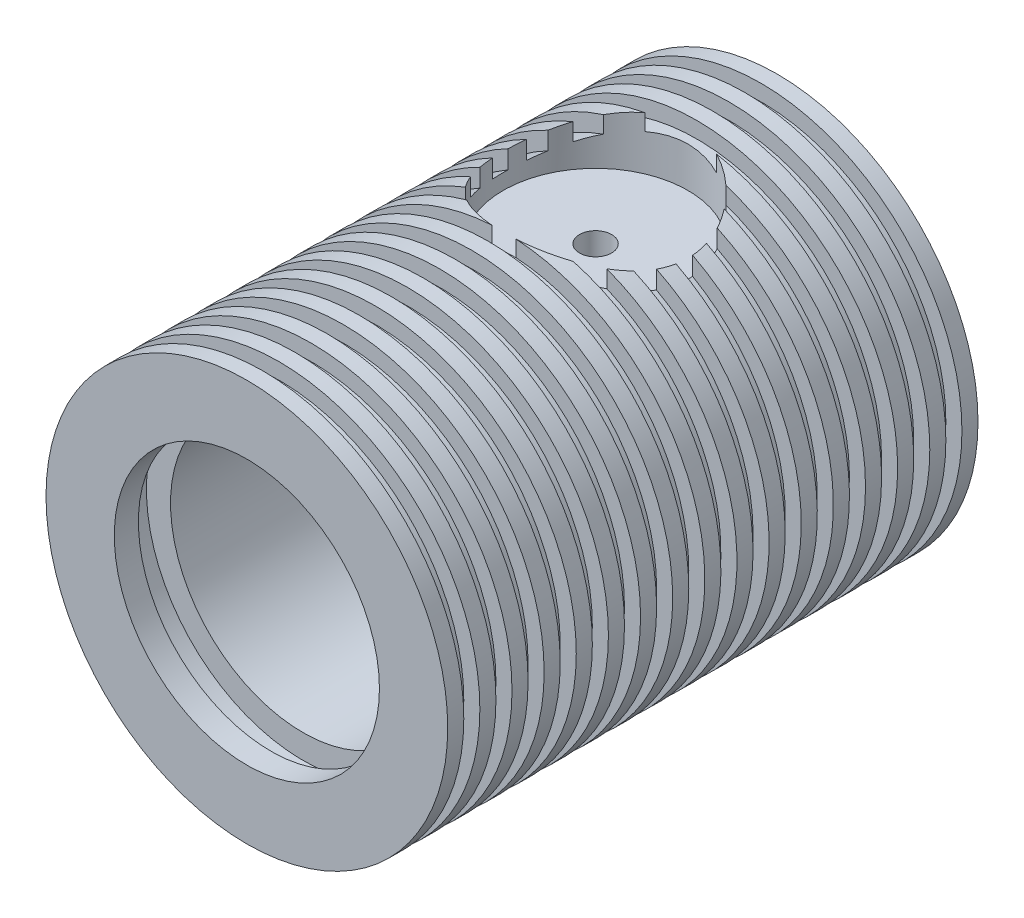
from build123d import *

# Parameters (mm, degrees)
SKETCH1_R                 = 12.5
CYLINDEROD_DEPTH          = 16.5
SKETCH2_R                 = 8.25
CUT_EXTRUDE1_DEPTH        = 20.5
SKETCH3_R                 = 7.25
CUT_EXTRUDE2_DEPTH        = 3.5
SKETCH4_R                 = 3
CUT_EXTRUDE3_DEPTH        = 8
SKETCH5_R                 = 1.25
PISTON_SHAFT_HOLE_DEPTH   = 1
SKETCH7_W                 = 2
SKETCH7_H                 = 1.5
SKETCH8_R                 = 2
MOUNT_HOLE_TOP_DEPTH      = 5
SKETCH9_R                 = 2
MOUNT_HOLE_BOTTOM_DEPTH   = 8
SKETCH12_R                = 5.75
POWER_CYLINDER_BORE_DEPTH = 3.5
AIR_HOLE_REACH            = 31.845
AIR_HOLE_END_RADIUS       = 7.25
SKETCH14_R                = 1
SKETCH15_W                = 1
SKETCH15_H                = 1
LPATTERN1_COUNT           = 16
LPATTERN1_PITCH           = 2


with BuildPart() as part:
    # Sketch1 → CylinderOD (new, symmetric)
    with BuildSketch(Plane.XY):
        Circle(SKETCH1_R)
    extrude(amount=CYLINDEROD_DEPTH, both=True)

    # Sketch2 → Cut-Extrude1 (cut)
    with BuildSketch(Plane.XY.offset(16.5)):
        Circle(SKETCH2_R)
    extrude(amount=-CUT_EXTRUDE1_DEPTH, mode=Mode.SUBTRACT)

    # Sketch3 → Cut-Extrude2 (cut)
    with BuildSketch(Plane.XY.offset(-4)):
        Circle(SKETCH3_R)
    extrude(amount=-CUT_EXTRUDE2_DEPTH, mode=Mode.SUBTRACT)

    # Sketch4 → Cut-Extrude3 (cut)
    with BuildSketch(Plane.XY.offset(-7.5)):
        Circle(SKETCH4_R)
    extrude(amount=-CUT_EXTRUDE3_DEPTH, mode=Mode.SUBTRACT)

    # Sketch5 → piston shaft hole (cut)
    with BuildSketch(Plane.XY.offset(-15.5)):
        Circle(SKETCH5_R)
    extrude(amount=-PISTON_SHAFT_HOLE_DEPTH, mode=Mode.SUBTRACT)

    # Sketch7 → ID Grooves (revolve, cut)
    with BuildSketch(Plane(origin=(0, 0, 0), x_dir=(0, 0, -1), z_dir=(1, 0, 0)), mode=Mode.PRIVATE) as id_grooves_sk:
        with Locations((-14, -9)):
            Rectangle(SKETCH7_W, SKETCH7_H)
        with Locations((-2.5, -9)):
            Rectangle(SKETCH7_W, SKETCH7_H)
    revolve(id_grooves_sk.sketch.rotate(Axis((0, 0, 16.5), (0, 0, -1)), 270), axis=Axis((0, 0, 16.5), (0, 0, -1)), mode=Mode.SUBTRACT)

    # Sketch8 → mount hole top (cut)
    with BuildSketch(Plane(origin=(0, 0, -16.5), x_dir=(-1, 0, 0), z_dir=(0, 0, -1))):
        with Locations((0, 8)):
            Circle(SKETCH8_R)
    extrude(amount=-MOUNT_HOLE_TOP_DEPTH, mode=Mode.SUBTRACT)

    # Sketch9 → mount hole bottom (cut)
    with BuildSketch(Plane(origin=(0, 0, -16.5), x_dir=(-1, 0, 0), z_dir=(0, 0, -1))):
        with Locations((0, -8)):
            Circle(SKETCH9_R)
    extrude(amount=-MOUNT_HOLE_BOTTOM_DEPTH, mode=Mode.SUBTRACT)

    # Sketch12 → power cylinder bore (cut)
    with BuildSketch(Plane(origin=(0, 12.5, 0), x_dir=(1, 0, 0), z_dir=(0, 1, 0))):
        with Locations(Location((0, 5.2, 0), (0, 0, 270))):
            Circle(SKETCH12_R)
    extrude(amount=-POWER_CYLINDER_BORE_DEPTH, mode=Mode.SUBTRACT)

    # Air hole: up to this cylinder (the profile starts outside it)
    air_hole_end = Plane(origin=(0, 0, -5.2), z_dir=(0, 0, 1)) * Cylinder(AIR_HOLE_END_RADIUS, 79.19, mode=Mode.PRIVATE)
    # Sketch14 → Air hole (cut, up to the surface)
    with BuildSketch(Plane(origin=(0, 9, 0), x_dir=(1, 0, 0), z_dir=(0, 1, 0)), mode=Mode.PRIVATE) as air_hole_sk1:
        with Locations(Location((0, 5.2, 0), (0, 0, 270))):
            Circle(SKETCH14_R)
    air_hole_tool1 = extrude(air_hole_sk1.sketch, amount=-AIR_HOLE_REACH, mode=Mode.PRIVATE) - air_hole_end
    add(air_hole_tool1.solids().sort_by_distance((0, 9, -5.2))[0], mode=Mode.SUBTRACT)

    # Sketch15 → Cut-Revolve2 (revolve, cut)
    with BuildSketch(Plane(origin=(0, 0, 0), x_dir=(0, 0, -1), z_dir=(1, 0, 0)), mode=Mode.PRIVATE) as cut_revolve2_sk:
        with Locations((-15, 12)):
            Rectangle(SKETCH15_W, SKETCH15_H)
    cut_revolve2 = revolve(cut_revolve2_sk.sketch.rotate(Axis((0, 0, 16.5), (0, 0, -1)), 90), axis=Axis((0, 0, 16.5), (0, 0, -1)), mode=Mode.SUBTRACT)

    # LPattern1: Cut-Revolve2 ×16
    with Locations(*[(0, 0, -i * LPATTERN1_PITCH) for i in range(1, LPATTERN1_COUNT)]):
        add(cut_revolve2, mode=Mode.SUBTRACT)


solid = part.part
